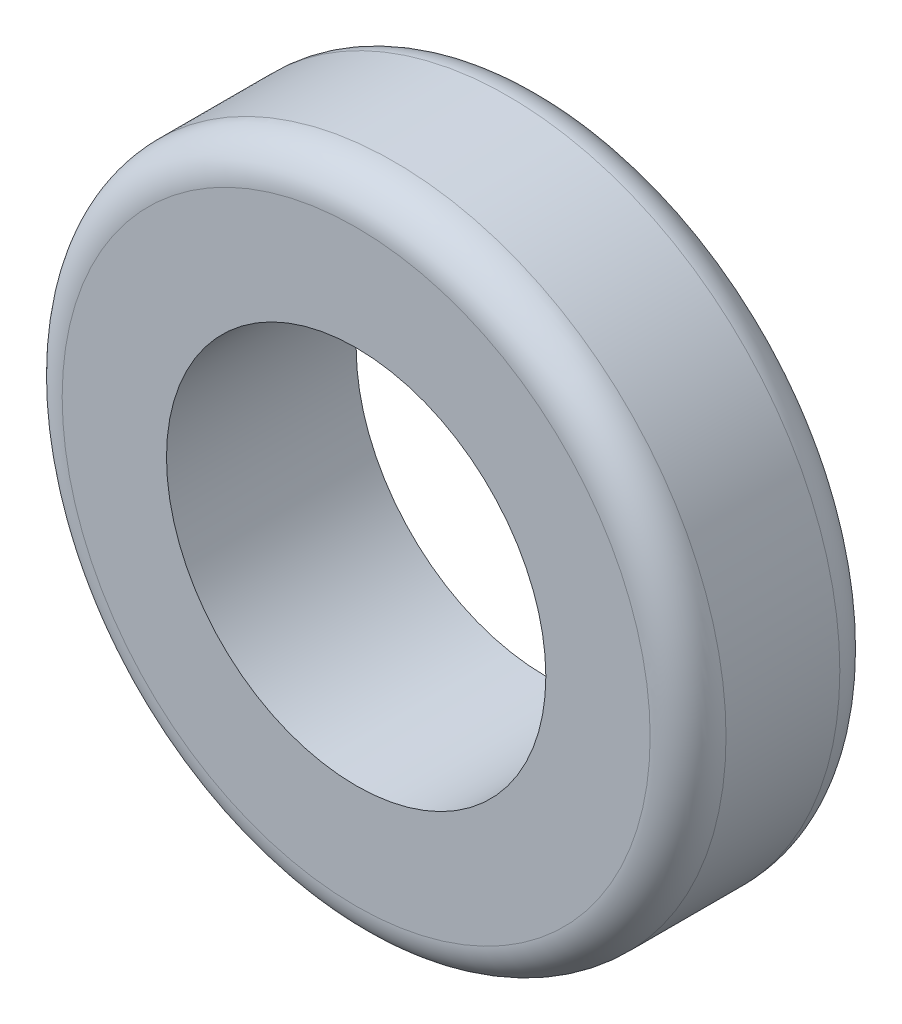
from build123d import *

# Parameters (mm, degrees)
ESQUISSE1_R             = 1.75
BASE_EXTRUSION_DEPTH    = 1
ESQUISSE2_R             = 1
ENL_V_MAT_EXTRU_1_DEPTH = 3.669269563
CONG_1_R                = 0.2


with BuildPart() as part:
    # Esquisse1 → Base-Extrusion (new body)
    with BuildSketch(Plane.XY):
        Circle(ESQUISSE1_R)
    extrude(amount=BASE_EXTRUSION_DEPTH)

    # Esquisse2 → Enl_v. mat.-Extru.1 (cut, through all)
    with BuildSketch(Plane.XY.offset(1)):
        Circle(ESQUISSE2_R)
    extrude(amount=-ENL_V_MAT_EXTRU_1_DEPTH, mode=Mode.SUBTRACT)

    # Cong_1
    cong_1_edges = [part.edges().sort_by_distance(p)[0] for p in [
        (-1.75, 0, 0),
        (-1.75, 0, 1),
    ]]
    fillet(cong_1_edges, radius=CONG_1_R)


solid = part.part
